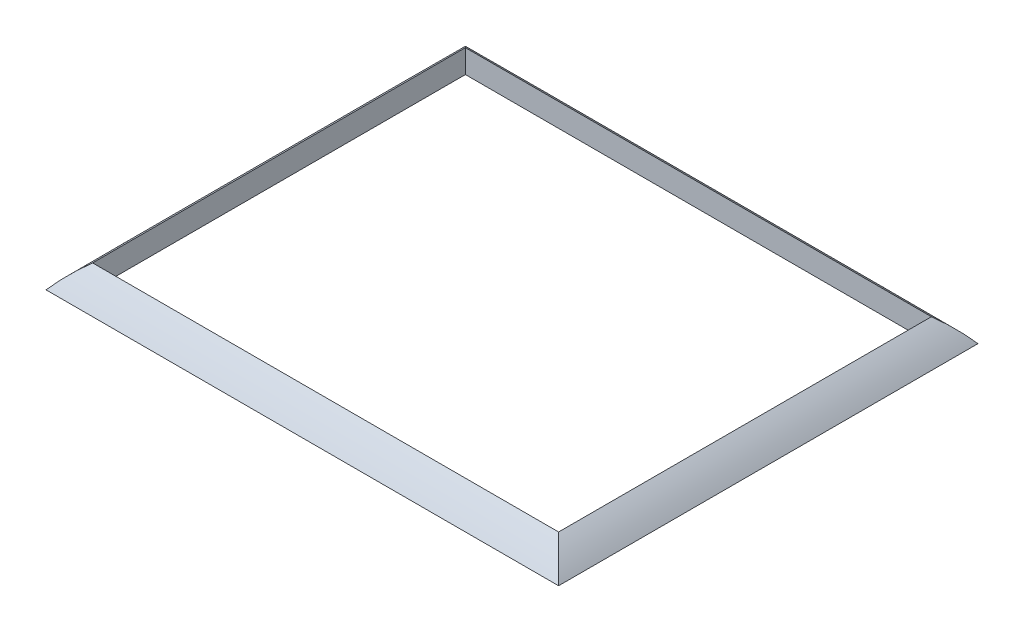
ISO-10303-21;
HEADER;
FILE_DESCRIPTION(('STEP AP214'),'2;1');
FILE_NAME('part.step','',(''),(''),'','','');
FILE_SCHEMA(('AUTOMOTIVE_DESIGN { 1 0 10303 214 1 1 1 1 }'));
ENDSEC;
DATA;
#1=APPLICATION_CONTEXT('core data for automotive mechanical design processes');
#2=APPLICATION_PROTOCOL_DEFINITION('international standard','automotive_design',2000,#1);
#3=PRODUCT_CONTEXT('',#1,'mechanical');
#4=PRODUCT('Part','Part','',(#3));
#5=PRODUCT_RELATED_PRODUCT_CATEGORY('part','',(#4));
#6=PRODUCT_DEFINITION_FORMATION('','',#4);
#7=PRODUCT_DEFINITION_CONTEXT('part definition',#1,'design');
#8=PRODUCT_DEFINITION('design','',#6,#7);
#9=PRODUCT_DEFINITION_SHAPE('','',#8);
#10=(LENGTH_UNIT() NAMED_UNIT(*) SI_UNIT(.MILLI.,.METRE.));
#11=(NAMED_UNIT(*) PLANE_ANGLE_UNIT() SI_UNIT($,.RADIAN.));
#12=(NAMED_UNIT(*) SI_UNIT($,.STERADIAN.) SOLID_ANGLE_UNIT());
#13=UNCERTAINTY_MEASURE_WITH_UNIT(LENGTH_MEASURE(1.E-05),#10,'distance_accuracy_value','');
#14=(GEOMETRIC_REPRESENTATION_CONTEXT(3) GLOBAL_UNCERTAINTY_ASSIGNED_CONTEXT((#13)) GLOBAL_UNIT_ASSIGNED_CONTEXT((#10,
#11,#12)) REPRESENTATION_CONTEXT('',''));
#15=CARTESIAN_POINT('',(0.,0.,0.));
#16=DIRECTION('',(0.,0.,1.));
#17=DIRECTION('',(1.,0.,0.));
#18=AXIS2_PLACEMENT_3D('',#15,#16,#17);
#19=CARTESIAN_POINT('',(348.796,-38.8820000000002,40.0000000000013));
#20=DIRECTION('',(0.,0.,-1.));
#21=DIRECTION('',(0.,-1.,0.));
#22=AXIS2_PLACEMENT_3D('',#19,#20,#21);
#23=PLANE('',#22);
#24=DIRECTION('',(-1.,0.,0.));
#25=VECTOR('',#24,1.);
#26=CARTESIAN_POINT('',(348.796,-33.8819999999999,40.0000000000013));
#27=LINE('',#26,#25);
#28=CARTESIAN_POINT('',(368.795999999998,-33.882,40.0000000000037));
#29=VERTEX_POINT('',#28);
#30=CARTESIAN_POINT('',(268.796000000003,-33.8820000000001,40.0000000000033));
#31=VERTEX_POINT('',#30);
#32=EDGE_CURVE('E111',#29,#31,#27,.T.);
#33=ORIENTED_EDGE('',*,*,#32,.F.);
#34=DIRECTION('',(0.,1.,0.));
#35=VECTOR('',#34,1.);
#36=CARTESIAN_POINT('',(368.796,-38.8820000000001,40.0000000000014));
#37=LINE('',#36,#35);
#38=CARTESIAN_POINT('',(368.796,-38.8820000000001,40.0000000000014));
#39=VERTEX_POINT('',#38);
#40=EDGE_CURVE('E155',#39,#29,#37,.T.);
#41=ORIENTED_EDGE('',*,*,#40,.F.);
#42=DIRECTION('',(1.,0.,0.));
#43=VECTOR('',#42,1.);
#44=CARTESIAN_POINT('',(348.796,-38.8820000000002,40.0000000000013));
#45=LINE('',#44,#43);
#46=CARTESIAN_POINT('',(268.796,-38.8820000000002,40.0000000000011));
#47=VERTEX_POINT('',#46);
#48=EDGE_CURVE('E143',#47,#39,#45,.T.);
#49=ORIENTED_EDGE('',*,*,#48,.F.);
#50=DIRECTION('',(0.,-1.,0.));
#51=VECTOR('',#50,1.);
#52=CARTESIAN_POINT('',(268.796,-38.8820000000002,40.0000000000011));
#53=LINE('',#52,#51);
#54=EDGE_CURVE('E124',#31,#47,#53,.T.);
#55=ORIENTED_EDGE('',*,*,#54,.F.);
#56=EDGE_LOOP('',(#33,#41,#49,#55));
#57=FACE_BOUND('',#56,.T.);
#58=ADVANCED_FACE('F66',(#57),#23,.T.);
#59=CARTESIAN_POINT('',(348.796,-38.8820000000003,-39.9999999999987));
#60=DIRECTION('',(0.,0.,1.));
#61=DIRECTION('',(0.,1.,0.));
#62=AXIS2_PLACEMENT_3D('',#59,#60,#61);
#63=PLANE('',#62);
#64=DIRECTION('',(0.,1.,0.));
#65=VECTOR('',#64,1.);
#66=CARTESIAN_POINT('',(268.796,-38.8820000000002,-39.9999999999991));
#67=LINE('',#66,#65);
#68=CARTESIAN_POINT('',(268.796,-38.8820000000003,-39.999999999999));
#69=VERTEX_POINT('',#68);
#70=CARTESIAN_POINT('',(268.795999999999,-33.8820000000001,-39.9999999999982));
#71=VERTEX_POINT('',#70);
#72=EDGE_CURVE('E115',#69,#71,#67,.T.);
#73=ORIENTED_EDGE('',*,*,#72,.F.);
#74=DIRECTION('',(1.,0.,0.));
#75=VECTOR('',#74,1.);
#76=CARTESIAN_POINT('',(348.796,-38.8820000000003,-39.9999999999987));
#77=LINE('',#76,#75);
#78=CARTESIAN_POINT('',(368.796,-38.8820000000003,-39.9999999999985));
#79=VERTEX_POINT('',#78);
#80=EDGE_CURVE('E153',#69,#79,#77,.T.);
#81=ORIENTED_EDGE('',*,*,#80,.T.);
#82=DIRECTION('',(0.,-1.,0.));
#83=VECTOR('',#82,1.);
#84=CARTESIAN_POINT('',(368.796,-38.8820000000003,-39.9999999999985));
#85=LINE('',#84,#83);
#86=CARTESIAN_POINT('',(368.796,-33.8820000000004,-39.9999999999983));
#87=VERTEX_POINT('',#86);
#88=EDGE_CURVE('E123',#87,#79,#85,.T.);
#89=ORIENTED_EDGE('',*,*,#88,.F.);
#90=DIRECTION('',(-1.,0.,0.));
#91=VECTOR('',#90,1.);
#92=CARTESIAN_POINT('',(348.796,-33.8820000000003,-39.9999999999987));
#93=LINE('',#92,#91);
#94=EDGE_CURVE('E127',#71,#87,#93,.F.);
#95=ORIENTED_EDGE('',*,*,#94,.F.);
#96=EDGE_LOOP('',(#73,#81,#89,#95));
#97=FACE_BOUND('',#96,.T.);
#98=ADVANCED_FACE('F128',(#97),#63,.T.);
#99=CARTESIAN_POINT('',(368.796,21.1179999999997,40.0000000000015));
#100=DIRECTION('',(-1.,0.,0.));
#101=DIRECTION('',(0.,0.,-1.));
#102=AXIS2_PLACEMENT_3D('',#99,#100,#101);
#103=PLANE('',#102);
#104=ORIENTED_EDGE('',*,*,#88,.T.);
#105=DIRECTION('',(0.,0.,1.));
#106=VECTOR('',#105,1.);
#107=CARTESIAN_POINT('',(368.796,-38.8820000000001,40.0000000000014));
#108=LINE('',#107,#106);
#109=EDGE_CURVE('E140',#79,#39,#108,.T.);
#110=ORIENTED_EDGE('',*,*,#109,.T.);
#111=ORIENTED_EDGE('',*,*,#40,.T.);
#112=DIRECTION('',(0.,0.,-1.));
#113=VECTOR('',#112,1.);
#114=CARTESIAN_POINT('',(368.796,-33.8820000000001,40.0000000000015));
#115=LINE('',#114,#113);
#116=EDGE_CURVE('E134',#87,#29,#115,.F.);
#117=ORIENTED_EDGE('',*,*,#116,.F.);
#118=EDGE_LOOP('',(#104,#110,#111,#117));
#119=FACE_BOUND('',#118,.T.);
#120=ADVANCED_FACE('F189',(#119),#103,.T.);
#121=CARTESIAN_POINT('',(268.796000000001,-38.8820000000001,140.000000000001));
#122=DIRECTION('',(-1.,0.,0.));
#123=DIRECTION('',(0.,0.,-1.));
#124=AXIS2_PLACEMENT_3D('',#121,#122,#123);
#125=PLANE('',#124);
#126=DIRECTION('',(0.,0.,-1.));
#127=VECTOR('',#126,1.);
#128=CARTESIAN_POINT('',(268.796000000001,-33.8820000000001,140.000000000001));
#129=LINE('',#128,#127);
#130=EDGE_CURVE('E104',#31,#71,#129,.T.);
#131=ORIENTED_EDGE('',*,*,#130,.F.);
#132=ORIENTED_EDGE('',*,*,#54,.T.);
#133=DIRECTION('',(0.,0.,-1.));
#134=VECTOR('',#133,1.);
#135=CARTESIAN_POINT('',(268.796000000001,-38.8820000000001,140.000000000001));
#136=LINE('',#135,#134);
#137=EDGE_CURVE('E120',#47,#69,#136,.T.);
#138=ORIENTED_EDGE('',*,*,#137,.T.);
#139=ORIENTED_EDGE('',*,*,#72,.T.);
#140=EDGE_LOOP('',(#131,#132,#138,#139));
#141=FACE_BOUND('',#140,.T.);
#142=ADVANCED_FACE('F117',(#141),#125,.F.);
#143=CARTESIAN_POINT('',(378.796,-38.8820000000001,-92.5597430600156));
#144=DIRECTION('',(0.,-1.,0.));
#145=DIRECTION('',(0.,0.,-1.));
#146=AXIS2_PLACEMENT_3D('',#143,#144,#145);
#147=PLANE('',#146);
#148=ORIENTED_EDGE('',*,*,#80,.F.);
#149=ORIENTED_EDGE('',*,*,#137,.F.);
#150=ORIENTED_EDGE('',*,*,#48,.T.);
#151=ORIENTED_EDGE('',*,*,#109,.F.);
#152=EDGE_LOOP('',(#148,#149,#150,#151));
#153=FACE_BOUND('',#152,.T.);
#154=DIRECTION('',(0.,0.,-1.));
#155=VECTOR('',#154,1.);
#156=CARTESIAN_POINT('',(373.796,-38.8820000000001,-92.5597430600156));
#157=LINE('',#156,#155);
#158=CARTESIAN_POINT('',(373.796,-38.8820000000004,-44.9999999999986));
#159=VERTEX_POINT('',#158);
#160=CARTESIAN_POINT('',(373.796,-38.8820000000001,45.0000000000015));
#161=VERTEX_POINT('',#160);
#162=EDGE_CURVE('E159',#159,#161,#157,.F.);
#163=ORIENTED_EDGE('',*,*,#162,.T.);
#164=DIRECTION('',(1.,0.,0.));
#165=VECTOR('',#164,1.);
#166=CARTESIAN_POINT('',(378.796,-38.8820000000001,45.0000000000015));
#167=LINE('',#166,#165);
#168=CARTESIAN_POINT('',(263.796,-38.8820000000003,45.0000000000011));
#169=VERTEX_POINT('',#168);
#170=EDGE_CURVE('E78',#161,#169,#167,.F.);
#171=ORIENTED_EDGE('',*,*,#170,.T.);
#172=DIRECTION('',(0.,0.,-1.));
#173=VECTOR('',#172,1.);
#174=CARTESIAN_POINT('',(263.796,-38.8820000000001,-92.5597430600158));
#175=LINE('',#174,#173);
#176=CARTESIAN_POINT('',(263.796,-38.8820000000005,-44.9999999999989));
#177=VERTEX_POINT('',#176);
#178=EDGE_CURVE('E12',#169,#177,#175,.T.);
#179=ORIENTED_EDGE('',*,*,#178,.T.);
#180=DIRECTION('',(1.,0.,0.));
#181=VECTOR('',#180,1.);
#182=CARTESIAN_POINT('',(378.796,-38.8820000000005,-44.9999999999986));
#183=LINE('',#182,#181);
#184=EDGE_CURVE('E133',#177,#159,#183,.T.);
#185=ORIENTED_EDGE('',*,*,#184,.T.);
#186=EDGE_LOOP('',(#163,#171,#179,#185));
#187=FACE_BOUND('',#186,.T.);
#188=ADVANCED_FACE('F177',(#153,#187),#147,.T.);
#189=CARTESIAN_POINT('',(268.796,-33.8820000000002,-39.999999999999));
#190=CARTESIAN_POINT('',(272.962666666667,-33.8820000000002,-39.9999999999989));
#191=CARTESIAN_POINT('',(278.265696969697,-33.8820000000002,-39.999999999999));
#192=CARTESIAN_POINT('',(286.59903030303,-33.8820000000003,-39.9999999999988));
#193=CARTESIAN_POINT('',(291.523272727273,-33.8820000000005,-39.9999999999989));
#194=CARTESIAN_POINT('',(297.331353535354,-33.8820000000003,-39.9999999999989));
#195=CARTESIAN_POINT('',(301.49802020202,-33.8820000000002,-39.9999999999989));
#196=CARTESIAN_POINT('',(309.073777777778,-33.8820000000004,-39.9999999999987));
#197=CARTESIAN_POINT('',(318.333037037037,-33.8820000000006,-39.9999999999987));
#198=CARTESIAN_POINT('',(328.055259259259,-33.8820000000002,-39.9999999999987));
#199=CARTESIAN_POINT('',(335.462666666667,-33.8820000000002,-39.9999999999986));
#200=CARTESIAN_POINT('',(340.092296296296,-33.8820000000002,-39.9999999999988));
#201=CARTESIAN_POINT('',(345.647851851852,-33.8820000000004,-39.9999999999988));
#202=CARTESIAN_POINT('',(350.740444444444,-33.8820000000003,-39.9999999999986));
#203=CARTESIAN_POINT('',(359.073777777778,-33.8820000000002,-39.9999999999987));
#204=CARTESIAN_POINT('',(364.629333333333,-33.8820000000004,-39.9999999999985));
#205=CARTESIAN_POINT('',(368.796,-33.8820000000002,-39.9999999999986));
#206=CARTESIAN_POINT('',(266.996807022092,-35.2724905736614,-41.7991929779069));
#207=CARTESIAN_POINT('',(271.345557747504,-35.2724986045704,-41.8433552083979));
#208=CARTESIAN_POINT('',(276.907256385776,-35.3046486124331,-41.8938006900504));
#209=CARTESIAN_POINT('',(285.553496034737,-35.3144202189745,-41.9076123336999));
#210=CARTESIAN_POINT('',(290.617396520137,-35.3077814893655,-41.8983058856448));
#211=CARTESIAN_POINT('',(296.608858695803,-35.3054348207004,-41.8949381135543));
#212=CARTESIAN_POINT('',(300.916201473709,-35.3059595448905,-41.8956946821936));
#213=CARTESIAN_POINT('',(308.753973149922,-35.3078293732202,-41.8983741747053));
#214=CARTESIAN_POINT('',(318.317772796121,-35.3064445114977,-41.8963924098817));
#215=CARTESIAN_POINT('',(328.360144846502,-35.3077707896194,-41.8982899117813));
#216=CARTESIAN_POINT('',(336.024494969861,-35.3057294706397,-41.8953643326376));
#217=CARTESIAN_POINT('',(340.80965102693,-35.3053224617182,-41.8947772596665));
#218=CARTESIAN_POINT('',(346.540645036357,-35.3075420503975,-41.8979636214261));
#219=CARTESIAN_POINT('',(351.77869038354,-35.314067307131,-41.9071174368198));
#220=CARTESIAN_POINT('',(360.419129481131,-35.3061452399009,-41.8959627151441));
#221=CARTESIAN_POINT('',(366.24638965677,-35.2724825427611,-41.8433104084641));
#222=CARTESIAN_POINT('',(370.595192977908,-35.2724905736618,-41.7991929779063));
#223=CARTESIAN_POINT('',(265.322724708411,-36.9465728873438,-43.4732752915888));
#224=CARTESIAN_POINT('',(269.811930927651,-36.9465817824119,-43.5190041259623));
#225=CARTESIAN_POINT('',(275.555659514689,-36.9821912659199,-43.5714998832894));
#226=CARTESIAN_POINT('',(284.482282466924,-36.9930143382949,-43.5856668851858));
#227=CARTESIAN_POINT('',(289.708508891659,-36.9856612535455,-43.5761325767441));
#228=CARTESIAN_POINT('',(295.892971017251,-36.9830620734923,-43.5726705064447));
#229=CARTESIAN_POINT('',(300.339323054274,-36.9836432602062,-43.5734487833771));
#230=CARTESIAN_POINT('',(308.430111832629,-36.9857142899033,-43.5762027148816));
#231=CARTESIAN_POINT('',(318.302346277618,-36.9841804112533,-43.5741662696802));
#232=CARTESIAN_POINT('',(328.668595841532,-36.9856494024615,-43.5761161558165));
#233=CARTESIAN_POINT('',(336.580388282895,-36.9833884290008,-43.5731090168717));
#234=CARTESIAN_POINT('',(341.519955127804,-36.9829376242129,-43.5725050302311));
#235=CARTESIAN_POINT('',(347.435565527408,-36.9853960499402,-43.5757809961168));
#236=CARTESIAN_POINT('',(352.841588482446,-36.9926234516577,-43.5851609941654));
#237=CARTESIAN_POINT('',(361.76194083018,-36.983848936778,-43.5737244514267));
#238=CARTESIAN_POINT('',(367.780016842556,-36.9465639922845,-43.5189589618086));
#239=CARTESIAN_POINT('',(372.26927529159,-36.9465728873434,-43.4732752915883));
#240=CARTESIAN_POINT('',(263.796,-38.8820000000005,-44.9999999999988));
#241=CARTESIAN_POINT('',(268.379333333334,-38.8820000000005,-44.9999999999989));
#242=CARTESIAN_POINT('',(274.212666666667,-38.8820000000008,-44.999999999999));
#243=CARTESIAN_POINT('',(283.379333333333,-38.8820000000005,-44.9999999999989));
#244=CARTESIAN_POINT('',(288.796,-38.8820000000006,-44.999999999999));
#245=CARTESIAN_POINT('',(295.184888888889,-38.8820000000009,-44.9999999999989));
#246=CARTESIAN_POINT('',(299.768222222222,-38.8820000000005,-44.9999999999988));
#247=CARTESIAN_POINT('',(308.101555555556,-38.8820000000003,-44.9999999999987));
#248=CARTESIAN_POINT('',(318.286740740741,-38.8820000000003,-44.9999999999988));
#249=CARTESIAN_POINT('',(328.981185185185,-38.8820000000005,-44.9999999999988));
#250=CARTESIAN_POINT('',(337.129333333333,-38.8820000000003,-44.9999999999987));
#251=CARTESIAN_POINT('',(342.221925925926,-38.8820000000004,-44.9999999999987));
#252=CARTESIAN_POINT('',(348.333037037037,-38.8820000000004,-44.9999999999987));
#253=CARTESIAN_POINT('',(353.934888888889,-38.8820000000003,-44.9999999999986));
#254=CARTESIAN_POINT('',(363.101555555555,-38.8820000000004,-44.9999999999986));
#255=CARTESIAN_POINT('',(369.212666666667,-38.8820000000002,-44.9999999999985));
#256=CARTESIAN_POINT('',(373.796,-38.8820000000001,-44.9999999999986));
#257=(BOUNDED_SURFACE() B_SPLINE_SURFACE(3,3,((#189,#190,#191,#192,#193,#194,#195,#196,#197,
#198,#199,#200,#201,#202,#203,#204,#205),(#206,#207,#208,#209,#210,#211,#212,#213,#214,#215,
#216,#217,#218,#219,#220,#221,#222),(#223,#224,#225,#226,#227,#228,#229,#230,#231,#232,#233,
#234,#235,#236,#237,#238,#239),(#240,#241,#242,#243,#244,#245,#246,#247,#248,#249,#250,#251,
#252,#253,#254,#255,#256)),.UNSPECIFIED.,.F.,.F.,.F.) B_SPLINE_SURFACE_WITH_KNOTS((4,4),(4,1,1,
1,1,1,1,1,1,1,1,1,1,1,4),(0.,1.),(0.,0.0312499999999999,0.0397727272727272,0.0625000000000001,
0.0681818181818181,0.0833333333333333,0.0937499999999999,0.125,0.152777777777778,
0.166666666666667,0.180555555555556,0.1875,0.208333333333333,0.21875,0.25),
.UNSPECIFIED.) GEOMETRIC_REPRESENTATION_ITEM() RATIONAL_B_SPLINE_SURFACE(((1.,1.,1.,1.,1.,1.,1.,
1.,1.,1.,1.,1.,1.,1.,1.,1.,1.),(0.995570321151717,0.995569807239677,0.993516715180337,
0.992894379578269,0.993317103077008,0.993466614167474,0.993433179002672,0.993314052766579,
0.993402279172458,0.993317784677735,0.99344783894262,0.993473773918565,0.993332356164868,
0.992916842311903,0.993421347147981,0.995570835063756,0.995570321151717),(0.995570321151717,
0.995569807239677,0.993516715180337,0.992894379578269,0.993317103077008,0.993466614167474,
0.993433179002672,0.993314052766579,0.993402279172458,0.993317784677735,0.99344783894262,
0.993473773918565,0.993332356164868,0.992916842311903,0.993421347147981,0.995570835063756,
0.995570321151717),(1.,1.,1.,1.,1.,1.,1.,1.,1.,1.,1.,1.,1.,1.,1.,1.,1.))) REPRESENTATION_ITEM('') SURFACE());
#258=CARTESIAN_POINT('',(281.554279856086,-66.8985597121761,-27.2417201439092));
#259=DIRECTION('',(-0.707106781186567,0.,0.707106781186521));
#260=DIRECTION('',(0.707106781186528,0.,0.707106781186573));
#261=AXIS2_PLACEMENT_3D('',#258,#259,#260);
#262=CIRCLE('',#261,37.6250000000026);
#263=EDGE_CURVE('E72',#71,#177,#262,.T.);
#264=CARTESIAN_POINT('',(356.037720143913,-66.8985597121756,-27.24172014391));
#265=DIRECTION('',(-0.707106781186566,0.,-0.707106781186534));
#266=DIRECTION('',(-0.707106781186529,0.,0.70710678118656));
#267=AXIS2_PLACEMENT_3D('',#264,#265,#266);
#268=CIRCLE('',#267,37.6250000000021);
#269=EDGE_CURVE('E139',#87,#159,#268,.T.);
#270=ORIENTED_EDGE('',*,*,#263,.F.);
#271=ORIENTED_EDGE('',*,*,#94,.T.);
#272=ORIENTED_EDGE('',*,*,#269,.T.);
#273=ORIENTED_EDGE('',*,*,#184,.F.);
#274=EDGE_LOOP('',(#270,#271,#272,#273));
#275=FACE_BOUND('',#274,.T.);
#276=ADVANCED_FACE('F137',(#275),#257,.F.);
#277=CARTESIAN_POINT('',(368.796,-33.8820000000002,-39.9999999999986));
#278=CARTESIAN_POINT('',(368.796,-33.8820000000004,-36.6666666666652));
#279=CARTESIAN_POINT('',(368.796,-33.8820000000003,-32.4242424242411));
#280=CARTESIAN_POINT('',(368.796,-33.8820000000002,-25.7575757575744));
#281=CARTESIAN_POINT('',(368.796,-33.8820000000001,-21.8181818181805));
#282=CARTESIAN_POINT('',(368.796,-33.882,-17.1717171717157));
#283=CARTESIAN_POINT('',(368.796,-33.882,-13.8383838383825));
#284=CARTESIAN_POINT('',(368.796,-33.882,-7.77777777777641));
#285=CARTESIAN_POINT('',(368.796,-33.882,-0.37037037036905));
#286=CARTESIAN_POINT('',(368.796,-33.8820000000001,7.40740740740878));
#287=CARTESIAN_POINT('',(368.796,-33.8820000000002,13.3333333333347));
#288=CARTESIAN_POINT('',(368.796,-33.882,17.0370370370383));
#289=CARTESIAN_POINT('',(368.796,-33.8820000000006,21.481481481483));
#290=CARTESIAN_POINT('',(368.796,-33.8820000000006,25.5555555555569));
#291=CARTESIAN_POINT('',(368.796,-33.8820000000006,32.2222222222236));
#292=CARTESIAN_POINT('',(368.796,-33.8820000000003,36.6666666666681));
#293=CARTESIAN_POINT('',(368.796,-33.8820000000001,40.0000000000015));
#294=CARTESIAN_POINT('',(370.595192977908,-35.2724905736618,-41.7991929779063));
#295=CARTESIAN_POINT('',(370.638443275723,-35.2724986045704,-38.2828511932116));
#296=CARTESIAN_POINT('',(370.689796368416,-35.304648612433,-33.7823954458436));
#297=CARTESIAN_POINT('',(370.703570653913,-35.3144202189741,-26.8048519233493));
#298=CARTESIAN_POINT('',(370.694305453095,-35.3077814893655,-22.7242969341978));
#299=CARTESIAN_POINT('',(370.690936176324,-35.3054348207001,-17.8936209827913));
#300=CARTESIAN_POINT('',(370.691693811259,-35.3059595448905,-14.4197222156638));
#301=CARTESIAN_POINT('',(370.694373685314,-35.3078293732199,-8.09801360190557));
#302=CARTESIAN_POINT('',(370.69239214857,-35.3064445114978,-0.385656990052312));
#303=CARTESIAN_POINT('',(370.694289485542,-35.307770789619,7.71266472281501));
#304=CARTESIAN_POINT('',(370.691363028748,-35.3057294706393,13.8945903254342));
#305=CARTESIAN_POINT('',(370.690775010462,-35.3053224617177,17.7537641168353));
#306=CARTESIAN_POINT('',(370.693963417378,-35.3075420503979,22.374447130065));
#307=CARTESIAN_POINT('',(370.703079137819,-35.3140673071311,26.5954999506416));
#308=CARTESIAN_POINT('',(370.691962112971,-35.3061452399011,33.5674630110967));
#309=CARTESIAN_POINT('',(370.638385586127,-35.2724825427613,38.2828106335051));
#310=CARTESIAN_POINT('',(370.595192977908,-35.2724905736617,41.7991929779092));
#311=CARTESIAN_POINT('',(372.26927529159,-36.9465728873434,-43.4732752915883));
#312=CARTESIAN_POINT('',(372.314092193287,-36.9465817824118,-39.8164780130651));
#313=CARTESIAN_POINT('',(372.367495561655,-36.9821912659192,-35.1339923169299));
#314=CARTESIAN_POINT('',(372.381625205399,-36.9930143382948,-27.8760654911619));
#315=CARTESIAN_POINT('',(372.372132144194,-36.9856612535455,-23.6331845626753));
#316=CARTESIAN_POINT('',(372.368668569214,-36.9830620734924,-18.6095086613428));
#317=CARTESIAN_POINT('',(372.369447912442,-36.9836432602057,-14.9966006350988));
#318=CARTESIAN_POINT('',(372.372202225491,-36.9857142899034,-8.42187491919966));
#319=CARTESIAN_POINT('',(372.370166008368,-36.9841804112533,-0.40108350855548));
#320=CARTESIAN_POINT('',(372.372115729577,-36.9856494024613,8.02111571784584));
#321=CARTESIAN_POINT('',(372.369107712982,-36.9833884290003,14.4504836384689));
#322=CARTESIAN_POINT('',(372.368502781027,-36.9829376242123,18.4640682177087));
#323=CARTESIAN_POINT('',(372.371780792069,-36.9853960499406,23.2693676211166));
#324=CARTESIAN_POINT('',(372.381122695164,-36.9926234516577,27.6583980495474));
#325=CARTESIAN_POINT('',(372.369723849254,-36.9838489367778,34.9102743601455));
#326=CARTESIAN_POINT('',(372.314034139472,-36.9465639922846,39.8164378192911));
#327=CARTESIAN_POINT('',(372.26927529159,-36.9465728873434,43.4732752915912));
#328=CARTESIAN_POINT('',(373.796,-38.8820000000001,-44.9999999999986));
#329=CARTESIAN_POINT('',(373.796,-38.8820000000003,-41.2499999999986));
#330=CARTESIAN_POINT('',(373.796,-38.8820000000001,-36.4772727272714));
#331=CARTESIAN_POINT('',(373.796,-38.8820000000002,-28.9772727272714));
#332=CARTESIAN_POINT('',(373.796,-38.8820000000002,-24.5454545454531));
#333=CARTESIAN_POINT('',(373.796,-38.8820000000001,-19.3181818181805));
#334=CARTESIAN_POINT('',(373.796,-38.8820000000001,-15.5681818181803));
#335=CARTESIAN_POINT('',(373.796,-38.8820000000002,-8.74999999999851));
#336=CARTESIAN_POINT('',(373.796,-38.8820000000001,-0.416666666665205));
#337=CARTESIAN_POINT('',(373.796,-38.8819999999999,8.33333333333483));
#338=CARTESIAN_POINT('',(373.796,-38.882,15.0000000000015));
#339=CARTESIAN_POINT('',(373.796,-38.8820000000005,19.1666666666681));
#340=CARTESIAN_POINT('',(373.796,-38.8820000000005,24.1666666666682));
#341=CARTESIAN_POINT('',(373.796,-38.8820000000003,28.7500000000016));
#342=CARTESIAN_POINT('',(373.796,-38.8820000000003,36.2500000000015));
#343=CARTESIAN_POINT('',(373.796,-38.8820000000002,41.2500000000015));
#344=CARTESIAN_POINT('',(373.796,-38.8820000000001,45.0000000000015));
#345=(BOUNDED_SURFACE() B_SPLINE_SURFACE(3,3,((#277,#278,#279,#280,#281,#282,#283,#284,#285,
#286,#287,#288,#289,#290,#291,#292,#293),(#294,#295,#296,#297,#298,#299,#300,#301,#302,#303,
#304,#305,#306,#307,#308,#309,#310),(#311,#312,#313,#314,#315,#316,#317,#318,#319,#320,#321,
#322,#323,#324,#325,#326,#327),(#328,#329,#330,#331,#332,#333,#334,#335,#336,#337,#338,#339,
#340,#341,#342,#343,#344)),.UNSPECIFIED.,.F.,.F.,.F.) B_SPLINE_SURFACE_WITH_KNOTS((4,4),(4,1,1,
1,1,1,1,1,1,1,1,1,1,1,4),(0.,1.),(0.25,0.28125,0.289772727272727,0.3125,0.318181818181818,
0.333333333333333,0.34375,0.375,0.402777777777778,0.416666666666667,0.430555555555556,0.4375,
0.458333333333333,0.46875,0.5),
.UNSPECIFIED.) GEOMETRIC_REPRESENTATION_ITEM() RATIONAL_B_SPLINE_SURFACE(((1.,1.,1.,1.,1.,1.,1.,
1.,1.,1.,1.,1.,1.,1.,1.,1.,1.),(0.995570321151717,0.995569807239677,0.993516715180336,
0.992894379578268,0.993317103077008,0.993466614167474,0.993433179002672,0.993314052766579,
0.993402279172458,0.993317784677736,0.99344783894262,0.993473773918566,0.993332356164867,
0.992916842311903,0.993421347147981,0.995570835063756,0.995570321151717),(0.995570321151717,
0.995569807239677,0.993516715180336,0.992894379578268,0.993317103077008,0.993466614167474,
0.993433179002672,0.993314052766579,0.993402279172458,0.993317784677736,0.99344783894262,
0.993473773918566,0.993332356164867,0.992916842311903,0.993421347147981,0.995570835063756,
0.995570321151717),(1.,1.,1.,1.,1.,1.,1.,1.,1.,1.,1.,1.,1.,1.,1.,1.,1.))) REPRESENTATION_ITEM('') SURFACE());
#346=CARTESIAN_POINT('',(356.03772014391,-66.8985597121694,27.2417201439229));
#347=DIRECTION('',(0.707106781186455,-1.89293025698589E-13,-0.707106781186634));
#348=DIRECTION('',(-0.70710678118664,0.,-0.707106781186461));
#349=AXIS2_PLACEMENT_3D('',#346,#347,#348);
#350=CIRCLE('',#349,37.6249999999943);
#351=EDGE_CURVE('E141',#29,#161,#350,.T.);
#352=ORIENTED_EDGE('',*,*,#269,.F.);
#353=ORIENTED_EDGE('',*,*,#116,.T.);
#354=ORIENTED_EDGE('',*,*,#351,.T.);
#355=ORIENTED_EDGE('',*,*,#162,.F.);
#356=EDGE_LOOP('',(#352,#353,#354,#355));
#357=FACE_BOUND('',#356,.T.);
#358=ADVANCED_FACE('F171',(#357),#345,.F.);
#359=CARTESIAN_POINT('',(368.796,-33.8820000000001,40.0000000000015));
#360=CARTESIAN_POINT('',(364.629333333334,-33.882,40.0000000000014));
#361=CARTESIAN_POINT('',(359.326303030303,-33.8820000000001,40.0000000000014));
#362=CARTESIAN_POINT('',(350.99296969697,-33.8820000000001,40.0000000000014));
#363=CARTESIAN_POINT('',(346.068727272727,-33.8820000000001,40.0000000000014));
#364=CARTESIAN_POINT('',(340.260646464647,-33.8820000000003,40.0000000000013));
#365=CARTESIAN_POINT('',(336.09397979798,-33.8819999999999,40.0000000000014));
#366=CARTESIAN_POINT('',(328.518222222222,-33.882,40.0000000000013));
#367=CARTESIAN_POINT('',(319.258962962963,-33.8820000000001,40.0000000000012));
#368=CARTESIAN_POINT('',(309.536740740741,-33.882,40.0000000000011));
#369=CARTESIAN_POINT('',(302.129333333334,-33.8820000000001,40.0000000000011));
#370=CARTESIAN_POINT('',(297.499703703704,-33.882,40.0000000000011));
#371=CARTESIAN_POINT('',(291.944148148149,-33.882,40.0000000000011));
#372=CARTESIAN_POINT('',(286.851555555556,-33.8820000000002,40.000000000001));
#373=CARTESIAN_POINT('',(278.518222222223,-33.8820000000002,40.000000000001));
#374=CARTESIAN_POINT('',(272.962666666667,-33.8820000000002,40.000000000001));
#375=CARTESIAN_POINT('',(268.796,-33.8820000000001,40.0000000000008));
#376=CARTESIAN_POINT('',(370.595192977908,-35.2724905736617,41.7991929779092));
#377=CARTESIAN_POINT('',(366.246442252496,-35.2724986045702,41.8433552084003));
#378=CARTESIAN_POINT('',(360.684743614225,-35.3046486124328,41.893800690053));
#379=CARTESIAN_POINT('',(352.038503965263,-35.314420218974,41.9076123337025));
#380=CARTESIAN_POINT('',(346.974603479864,-35.3077814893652,41.8983058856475));
#381=CARTESIAN_POINT('',(340.983141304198,-35.3054348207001,41.8949381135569));
#382=CARTESIAN_POINT('',(336.675798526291,-35.3059595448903,41.8956946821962));
#383=CARTESIAN_POINT('',(328.838026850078,-35.30782937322,41.898374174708));
#384=CARTESIAN_POINT('',(319.27422720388,-35.3064445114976,41.8963924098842));
#385=CARTESIAN_POINT('',(309.231855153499,-35.3077707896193,41.8982899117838));
#386=CARTESIAN_POINT('',(301.56750503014,-35.3057294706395,41.89536433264));
#387=CARTESIAN_POINT('',(296.78234897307,-35.3053224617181,41.894777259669));
#388=CARTESIAN_POINT('',(291.051354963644,-35.3075420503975,41.8979636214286));
#389=CARTESIAN_POINT('',(285.81330961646,-35.3140673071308,41.9071174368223));
#390=CARTESIAN_POINT('',(277.17287051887,-35.3061452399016,41.8959627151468));
#391=CARTESIAN_POINT('',(271.34561034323,-35.2724825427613,41.8433104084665));
#392=CARTESIAN_POINT('',(266.996807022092,-35.2724905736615,41.7991929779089));
#393=CARTESIAN_POINT('',(372.26927529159,-36.9465728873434,43.4732752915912));
#394=CARTESIAN_POINT('',(367.78006907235,-36.9465817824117,43.5190041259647));
#395=CARTESIAN_POINT('',(362.036340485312,-36.9821912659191,43.5714998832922));
#396=CARTESIAN_POINT('',(353.109717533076,-36.9930143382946,43.5856668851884));
#397=CARTESIAN_POINT('',(347.883491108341,-36.9856612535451,43.5761325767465));
#398=CARTESIAN_POINT('',(341.699028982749,-36.9830620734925,43.5726705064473));
#399=CARTESIAN_POINT('',(337.252676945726,-36.9836432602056,43.5734487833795));
#400=CARTESIAN_POINT('',(329.161888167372,-36.985714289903,43.5762027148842));
#401=CARTESIAN_POINT('',(319.289653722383,-36.9841804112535,43.5741662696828));
#402=CARTESIAN_POINT('',(308.923404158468,-36.9856494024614,43.576116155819));
#403=CARTESIAN_POINT('',(301.011611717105,-36.9833884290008,43.573109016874));
#404=CARTESIAN_POINT('',(296.072044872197,-36.9829376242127,43.5725050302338));
#405=CARTESIAN_POINT('',(290.156434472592,-36.9853960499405,43.5757809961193));
#406=CARTESIAN_POINT('',(284.750411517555,-36.9926234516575,43.585160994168));
#407=CARTESIAN_POINT('',(275.830059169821,-36.9838489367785,43.5737244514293));
#408=CARTESIAN_POINT('',(269.811983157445,-36.9465639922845,43.5189589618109));
#409=CARTESIAN_POINT('',(265.322724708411,-36.9465728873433,43.4732752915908));
#410=CARTESIAN_POINT('',(373.796,-38.8820000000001,45.0000000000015));
#411=CARTESIAN_POINT('',(369.212666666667,-38.8820000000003,45.0000000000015));
#412=CARTESIAN_POINT('',(363.379333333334,-38.8820000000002,45.0000000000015));
#413=CARTESIAN_POINT('',(354.212666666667,-38.8820000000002,45.0000000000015));
#414=CARTESIAN_POINT('',(348.796,-38.8820000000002,45.0000000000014));
#415=CARTESIAN_POINT('',(342.407111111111,-38.8820000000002,45.0000000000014));
#416=CARTESIAN_POINT('',(337.823777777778,-38.882,45.0000000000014));
#417=CARTESIAN_POINT('',(329.490444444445,-38.8820000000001,45.0000000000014));
#418=CARTESIAN_POINT('',(319.30525925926,-38.8820000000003,45.0000000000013));
#419=CARTESIAN_POINT('',(308.610814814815,-38.8820000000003,45.0000000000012));
#420=CARTESIAN_POINT('',(300.462666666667,-38.8820000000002,45.0000000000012));
#421=CARTESIAN_POINT('',(295.370074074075,-38.8820000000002,45.0000000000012));
#422=CARTESIAN_POINT('',(289.258962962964,-38.8820000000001,45.0000000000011));
#423=CARTESIAN_POINT('',(283.657111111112,-38.8820000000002,45.0000000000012));
#424=CARTESIAN_POINT('',(274.490444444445,-38.8820000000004,45.000000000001));
#425=CARTESIAN_POINT('',(268.379333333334,-38.8820000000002,45.0000000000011));
#426=CARTESIAN_POINT('',(263.796,-38.8820000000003,45.0000000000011));
#427=(BOUNDED_SURFACE() B_SPLINE_SURFACE(3,3,((#359,#360,#361,#362,#363,#364,#365,#366,#367,
#368,#369,#370,#371,#372,#373,#374,#375),(#376,#377,#378,#379,#380,#381,#382,#383,#384,#385,
#386,#387,#388,#389,#390,#391,#392),(#393,#394,#395,#396,#397,#398,#399,#400,#401,#402,#403,
#404,#405,#406,#407,#408,#409),(#410,#411,#412,#413,#414,#415,#416,#417,#418,#419,#420,#421,
#422,#423,#424,#425,#426)),.UNSPECIFIED.,.F.,.F.,.F.) B_SPLINE_SURFACE_WITH_KNOTS((4,4),(4,1,1,
1,1,1,1,1,1,1,1,1,1,1,4),(0.,1.),(0.5,0.53125,0.539772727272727,0.5625,0.568181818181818,
0.583333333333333,0.59375,0.625,0.652777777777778,0.666666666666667,0.680555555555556,0.6875,
0.708333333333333,0.71875,0.75),
.UNSPECIFIED.) GEOMETRIC_REPRESENTATION_ITEM() RATIONAL_B_SPLINE_SURFACE(((1.,1.,1.,1.,1.,1.,1.,
1.,1.,1.,1.,1.,1.,1.,1.,1.,1.),(0.995570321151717,0.995569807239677,0.993516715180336,
0.992894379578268,0.993317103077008,0.993466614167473,0.993433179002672,0.993314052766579,
0.993402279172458,0.993317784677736,0.99344783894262,0.993473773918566,0.993332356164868,
0.992916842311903,0.99342134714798,0.995570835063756,0.995570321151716),(0.995570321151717,
0.995569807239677,0.993516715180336,0.992894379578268,0.993317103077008,0.993466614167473,
0.993433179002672,0.993314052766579,0.993402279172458,0.993317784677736,0.99344783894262,
0.993473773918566,0.993332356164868,0.992916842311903,0.99342134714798,0.995570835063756,
0.995570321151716),(1.,1.,1.,1.,1.,1.,1.,1.,1.,1.,1.,1.,1.,1.,1.,1.,1.))) REPRESENTATION_ITEM('') SURFACE());
#428=CARTESIAN_POINT('',(281.554279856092,-66.8985597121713,27.2417201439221));
#429=DIRECTION('',(0.707106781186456,1.93178806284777E-13,0.707106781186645));
#430=DIRECTION('',(0.707106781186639,0.,-0.707106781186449));
#431=AXIS2_PLACEMENT_3D('',#428,#429,#430);
#432=CIRCLE('',#431,37.6249999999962);
#433=EDGE_CURVE('E108',#31,#169,#432,.T.);
#434=ORIENTED_EDGE('',*,*,#351,.F.);
#435=ORIENTED_EDGE('',*,*,#32,.T.);
#436=ORIENTED_EDGE('',*,*,#433,.T.);
#437=ORIENTED_EDGE('',*,*,#170,.F.);
#438=EDGE_LOOP('',(#434,#435,#436,#437));
#439=FACE_BOUND('',#438,.T.);
#440=ADVANCED_FACE('F173',(#439),#427,.F.);
#441=CARTESIAN_POINT('',(268.796,-33.8820000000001,40.0000000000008));
#442=CARTESIAN_POINT('',(268.796,-33.8820000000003,36.6666666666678));
#443=CARTESIAN_POINT('',(268.796,-33.8820000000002,32.4242424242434));
#444=CARTESIAN_POINT('',(268.796,-33.8820000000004,25.7575757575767));
#445=CARTESIAN_POINT('',(268.796,-33.8820000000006,21.8181818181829));
#446=CARTESIAN_POINT('',(268.796,-33.8819999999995,17.1717171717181));
#447=CARTESIAN_POINT('',(268.796,-33.882,13.8383838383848));
#448=CARTESIAN_POINT('',(268.796,-33.882,7.77777777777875));
#449=CARTESIAN_POINT('',(268.796,-33.8820000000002,0.37037037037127));
#450=CARTESIAN_POINT('',(268.796,-33.8820000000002,-7.40740740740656));
#451=CARTESIAN_POINT('',(268.796,-33.8819999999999,-13.3333333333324));
#452=CARTESIAN_POINT('',(268.796,-33.8820000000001,-17.037037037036));
#453=CARTESIAN_POINT('',(268.796,-33.8820000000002,-21.4814814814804));
#454=CARTESIAN_POINT('',(268.796,-33.8820000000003,-25.5555555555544));
#455=CARTESIAN_POINT('',(268.796,-33.8820000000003,-32.2222222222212));
#456=CARTESIAN_POINT('',(268.796,-33.8820000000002,-36.6666666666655));
#457=CARTESIAN_POINT('',(268.796,-33.8820000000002,-39.999999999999));
#458=CARTESIAN_POINT('',(266.996807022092,-35.2724905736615,41.7991929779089));
#459=CARTESIAN_POINT('',(266.953556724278,-35.2724986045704,38.2828511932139));
#460=CARTESIAN_POINT('',(266.902203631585,-35.3046486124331,33.782395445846));
#461=CARTESIAN_POINT('',(266.888429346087,-35.3144202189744,26.8048519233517));
#462=CARTESIAN_POINT('',(266.897694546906,-35.3077814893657,22.7242969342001));
#463=CARTESIAN_POINT('',(266.901063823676,-35.3054348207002,17.8936209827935));
#464=CARTESIAN_POINT('',(266.900306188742,-35.3059595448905,14.4197222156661));
#465=CARTESIAN_POINT('',(266.897626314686,-35.3078293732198,8.09801360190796));
#466=CARTESIAN_POINT('',(266.899607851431,-35.3064445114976,0.385656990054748));
#467=CARTESIAN_POINT('',(266.897710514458,-35.3077707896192,-7.71266472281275));
#468=CARTESIAN_POINT('',(266.900636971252,-35.3057294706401,-13.8945903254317));
#469=CARTESIAN_POINT('',(266.901224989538,-35.305322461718,-17.7537641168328));
#470=CARTESIAN_POINT('',(266.898036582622,-35.3075420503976,-22.3744471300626));
#471=CARTESIAN_POINT('',(266.888920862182,-35.3140673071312,-26.595499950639));
#472=CARTESIAN_POINT('',(266.900037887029,-35.3061452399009,-33.5674630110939));
#473=CARTESIAN_POINT('',(266.953614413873,-35.2724825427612,-38.2828106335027));
#474=CARTESIAN_POINT('',(266.996807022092,-35.2724905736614,-41.7991929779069));
#475=CARTESIAN_POINT('',(265.322724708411,-36.9465728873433,43.4732752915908));
#476=CARTESIAN_POINT('',(265.277907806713,-36.9465817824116,39.8164780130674));
#477=CARTESIAN_POINT('',(265.224504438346,-36.9821912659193,35.1339923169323));
#478=CARTESIAN_POINT('',(265.210374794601,-36.9930143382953,27.8760654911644));
#479=CARTESIAN_POINT('',(265.219867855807,-36.9856612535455,23.6331845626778));
#480=CARTESIAN_POINT('',(265.223331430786,-36.9830620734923,18.6095086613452));
#481=CARTESIAN_POINT('',(265.222552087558,-36.983643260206,14.9966006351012));
#482=CARTESIAN_POINT('',(265.219797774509,-36.9857142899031,8.42187491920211));
#483=CARTESIAN_POINT('',(265.221833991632,-36.9841804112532,0.401083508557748));
#484=CARTESIAN_POINT('',(265.219884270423,-36.9856494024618,-8.02111571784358));
#485=CARTESIAN_POINT('',(265.222892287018,-36.9833884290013,-14.4504836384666));
#486=CARTESIAN_POINT('',(265.223497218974,-36.9829376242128,-18.4640682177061));
#487=CARTESIAN_POINT('',(265.220219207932,-36.9853960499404,-23.2693676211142));
#488=CARTESIAN_POINT('',(265.210877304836,-36.9926234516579,-27.6583980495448));
#489=CARTESIAN_POINT('',(265.222276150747,-36.9838489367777,-34.9102743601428));
#490=CARTESIAN_POINT('',(265.277965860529,-36.9465639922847,-39.8164378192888));
#491=CARTESIAN_POINT('',(265.322724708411,-36.9465728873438,-43.4732752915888));
#492=CARTESIAN_POINT('',(263.796,-38.8820000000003,45.0000000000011));
#493=CARTESIAN_POINT('',(263.796,-38.8820000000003,41.250000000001));
#494=CARTESIAN_POINT('',(263.796,-38.8820000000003,36.4772727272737));
#495=CARTESIAN_POINT('',(263.796,-38.8820000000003,28.9772727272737));
#496=CARTESIAN_POINT('',(263.796,-38.8820000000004,24.5454545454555));
#497=CARTESIAN_POINT('',(263.796,-38.8820000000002,19.3181818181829));
#498=CARTESIAN_POINT('',(263.796,-38.8819999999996,15.5681818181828));
#499=CARTESIAN_POINT('',(263.796,-38.8819999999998,8.7500000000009));
#500=CARTESIAN_POINT('',(263.796,-38.8820000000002,0.416666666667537));
#501=CARTESIAN_POINT('',(263.796,-38.8820000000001,-8.33333333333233));
#502=CARTESIAN_POINT('',(263.796,-38.8820000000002,-14.999999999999));
#503=CARTESIAN_POINT('',(263.796,-38.8820000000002,-19.1666666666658));
#504=CARTESIAN_POINT('',(263.796,-38.8820000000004,-24.1666666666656));
#505=CARTESIAN_POINT('',(263.796,-38.8820000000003,-28.7499999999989));
#506=CARTESIAN_POINT('',(263.796,-38.8820000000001,-36.2499999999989));
#507=CARTESIAN_POINT('',(263.796,-38.8820000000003,-41.2499999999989));
#508=CARTESIAN_POINT('',(263.796,-38.8820000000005,-44.9999999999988));
#509=(BOUNDED_SURFACE() B_SPLINE_SURFACE(3,3,((#441,#442,#443,#444,#445,#446,#447,#448,#449,
#450,#451,#452,#453,#454,#455,#456,#457),(#458,#459,#460,#461,#462,#463,#464,#465,#466,#467,
#468,#469,#470,#471,#472,#473,#474),(#475,#476,#477,#478,#479,#480,#481,#482,#483,#484,#485,
#486,#487,#488,#489,#490,#491),(#492,#493,#494,#495,#496,#497,#498,#499,#500,#501,#502,#503,
#504,#505,#506,#507,#508)),.UNSPECIFIED.,.F.,.F.,.F.) B_SPLINE_SURFACE_WITH_KNOTS((4,4),(4,1,1,
1,1,1,1,1,1,1,1,1,1,1,4),(0.,1.),(0.75,0.78125,0.789772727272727,0.8125,0.818181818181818,
0.833333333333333,0.84375,0.875,0.902777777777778,0.916666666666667,0.930555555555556,0.9375,
0.958333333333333,0.96875,1.),
.UNSPECIFIED.) GEOMETRIC_REPRESENTATION_ITEM() RATIONAL_B_SPLINE_SURFACE(((1.,1.,1.,1.,1.,1.,1.,
1.,1.,1.,1.,1.,1.,1.,1.,1.,1.),(0.995570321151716,0.995569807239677,0.993516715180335,
0.992894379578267,0.993317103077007,0.993466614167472,0.99343317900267,0.993314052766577,
0.993402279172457,0.993317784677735,0.993447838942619,0.993473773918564,0.993332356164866,
0.992916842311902,0.99342134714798,0.995570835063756,0.995570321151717),(0.995570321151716,
0.995569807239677,0.993516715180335,0.992894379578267,0.993317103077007,0.993466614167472,
0.99343317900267,0.993314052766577,0.993402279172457,0.993317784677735,0.993447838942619,
0.993473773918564,0.993332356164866,0.992916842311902,0.99342134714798,0.995570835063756,
0.995570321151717),(1.,1.,1.,1.,1.,1.,1.,1.,1.,1.,1.,1.,1.,1.,1.,1.,1.))) REPRESENTATION_ITEM('') SURFACE());
#510=ORIENTED_EDGE('',*,*,#433,.F.);
#511=ORIENTED_EDGE('',*,*,#130,.T.);
#512=ORIENTED_EDGE('',*,*,#263,.T.);
#513=ORIENTED_EDGE('',*,*,#178,.F.);
#514=EDGE_LOOP('',(#510,#511,#512,#513));
#515=FACE_BOUND('',#514,.T.);
#516=ADVANCED_FACE('F68',(#515),#509,.F.);
#517=CLOSED_SHELL('',(#58,#98,#120,#142,#188,#276,#358,#440,#516));
#518=MANIFOLD_SOLID_BREP('B2',#517);
#519=ADVANCED_BREP_SHAPE_REPRESENTATION('',(#18,#518),#14);
#520=SHAPE_DEFINITION_REPRESENTATION(#9,#519);
ENDSEC;
END-ISO-10303-21;
